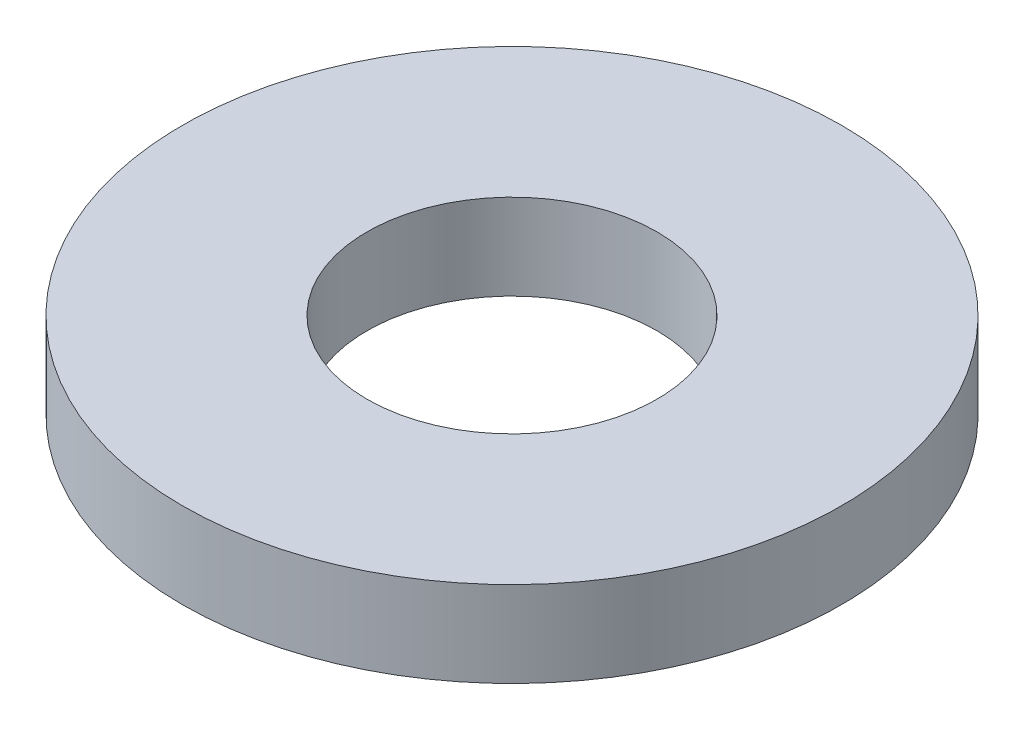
ISO-10303-21;
HEADER;
FILE_DESCRIPTION(('STEP AP214'),'2;1');
FILE_NAME('part.step','',(''),(''),'','','');
FILE_SCHEMA(('AUTOMOTIVE_DESIGN { 1 0 10303 214 1 1 1 1 }'));
ENDSEC;
DATA;
#1=APPLICATION_CONTEXT('core data for automotive mechanical design processes');
#2=APPLICATION_PROTOCOL_DEFINITION('international standard','automotive_design',2000,#1);
#3=PRODUCT_CONTEXT('',#1,'mechanical');
#4=PRODUCT('Part','Part','',(#3));
#5=PRODUCT_RELATED_PRODUCT_CATEGORY('part','',(#4));
#6=PRODUCT_DEFINITION_FORMATION('','',#4);
#7=PRODUCT_DEFINITION_CONTEXT('part definition',#1,'design');
#8=PRODUCT_DEFINITION('design','',#6,#7);
#9=PRODUCT_DEFINITION_SHAPE('','',#8);
#10=(LENGTH_UNIT() NAMED_UNIT(*) SI_UNIT(.MILLI.,.METRE.));
#11=(NAMED_UNIT(*) PLANE_ANGLE_UNIT() SI_UNIT($,.RADIAN.));
#12=(NAMED_UNIT(*) SI_UNIT($,.STERADIAN.) SOLID_ANGLE_UNIT());
#13=UNCERTAINTY_MEASURE_WITH_UNIT(LENGTH_MEASURE(1.E-05),#10,'distance_accuracy_value','');
#14=(GEOMETRIC_REPRESENTATION_CONTEXT(3) GLOBAL_UNCERTAINTY_ASSIGNED_CONTEXT((#13)) GLOBAL_UNIT_ASSIGNED_CONTEXT((#10,
#11,#12)) REPRESENTATION_CONTEXT('',''));
#15=CARTESIAN_POINT('',(0.,0.,0.));
#16=DIRECTION('',(0.,0.,1.));
#17=DIRECTION('',(1.,0.,0.));
#18=AXIS2_PLACEMENT_3D('',#15,#16,#17);
#19=CARTESIAN_POINT('',(0.,1.651,0.));
#20=DIRECTION('',(0.,-1.,0.));
#21=DIRECTION('',(0.,0.,-1.));
#22=AXIS2_PLACEMENT_3D('',#19,#20,#21);
#23=CYLINDRICAL_SURFACE('',#22,6.35);
#24=CARTESIAN_POINT('',(0.,1.651,0.));
#25=DIRECTION('',(0.,1.,0.));
#26=DIRECTION('',(0.,0.,1.));
#27=AXIS2_PLACEMENT_3D('',#24,#25,#26);
#28=CIRCLE('',#27,6.35);
#29=CARTESIAN_POINT('',(0.,1.651,-6.35));
#30=VERTEX_POINT('',#29);
#31=EDGE_CURVE('E10',#30,#30,#28,.T.);
#32=CARTESIAN_POINT('',(0.,0.,0.));
#33=DIRECTION('',(0.,1.,0.));
#34=DIRECTION('',(0.,0.,1.));
#35=AXIS2_PLACEMENT_3D('',#32,#33,#34);
#36=CIRCLE('',#35,6.35);
#37=CARTESIAN_POINT('',(0.,0.,-6.35));
#38=VERTEX_POINT('',#37);
#39=EDGE_CURVE('E34',#38,#38,#36,.T.);
#40=CARTESIAN_POINT('',(0.,1.651,-6.35));
#41=CARTESIAN_POINT('',(0.,1.63380208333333,-6.35));
#42=CARTESIAN_POINT('',(0.,1.61660416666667,-6.35));
#43=CARTESIAN_POINT('',(0.,1.58220833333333,-6.35));
#44=CARTESIAN_POINT('',(0.,1.56501041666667,-6.35));
#45=CARTESIAN_POINT('',(0.,1.53061458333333,-6.35));
#46=CARTESIAN_POINT('',(0.,1.51341666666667,-6.35));
#47=CARTESIAN_POINT('',(0.,1.47902083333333,-6.35));
#48=CARTESIAN_POINT('',(0.,1.46182291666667,-6.35));
#49=CARTESIAN_POINT('',(0.,1.42742708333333,-6.35));
#50=CARTESIAN_POINT('',(0.,1.41022916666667,-6.35));
#51=CARTESIAN_POINT('',(0.,1.37583333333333,-6.35));
#52=CARTESIAN_POINT('',(0.,1.35863541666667,-6.35));
#53=CARTESIAN_POINT('',(0.,1.32423958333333,-6.35));
#54=CARTESIAN_POINT('',(0.,1.30704166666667,-6.35));
#55=CARTESIAN_POINT('',(0.,1.27264583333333,-6.35));
#56=CARTESIAN_POINT('',(0.,1.25544791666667,-6.35));
#57=CARTESIAN_POINT('',(0.,1.22105208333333,-6.35));
#58=CARTESIAN_POINT('',(0.,1.20385416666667,-6.35));
#59=CARTESIAN_POINT('',(0.,1.16945833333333,-6.35));
#60=CARTESIAN_POINT('',(0.,1.15226041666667,-6.35));
#61=CARTESIAN_POINT('',(0.,1.11786458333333,-6.35));
#62=CARTESIAN_POINT('',(0.,1.10066666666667,-6.35));
#63=CARTESIAN_POINT('',(0.,1.06627083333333,-6.35));
#64=CARTESIAN_POINT('',(0.,1.04907291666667,-6.35));
#65=CARTESIAN_POINT('',(0.,1.01467708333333,-6.35));
#66=CARTESIAN_POINT('',(0.,0.997479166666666,-6.35));
#67=CARTESIAN_POINT('',(0.,0.963083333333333,-6.35));
#68=CARTESIAN_POINT('',(0.,0.945885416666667,-6.35));
#69=CARTESIAN_POINT('',(0.,0.911489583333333,-6.35));
#70=CARTESIAN_POINT('',(0.,0.894291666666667,-6.35));
#71=CARTESIAN_POINT('',(0.,0.859895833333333,-6.35));
#72=CARTESIAN_POINT('',(0.,0.842697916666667,-6.35));
#73=CARTESIAN_POINT('',(0.,0.808302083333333,-6.35));
#74=CARTESIAN_POINT('',(0.,0.791104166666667,-6.35));
#75=CARTESIAN_POINT('',(0.,0.756708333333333,-6.35));
#76=CARTESIAN_POINT('',(0.,0.739510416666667,-6.35));
#77=CARTESIAN_POINT('',(0.,0.705114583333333,-6.35));
#78=CARTESIAN_POINT('',(0.,0.687916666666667,-6.35));
#79=CARTESIAN_POINT('',(0.,0.653520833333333,-6.35));
#80=CARTESIAN_POINT('',(0.,0.636322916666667,-6.35));
#81=CARTESIAN_POINT('',(0.,0.601927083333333,-6.35));
#82=CARTESIAN_POINT('',(0.,0.584729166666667,-6.35));
#83=CARTESIAN_POINT('',(0.,0.550333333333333,-6.35));
#84=CARTESIAN_POINT('',(0.,0.533135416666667,-6.35));
#85=CARTESIAN_POINT('',(0.,0.498739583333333,-6.35));
#86=CARTESIAN_POINT('',(0.,0.481541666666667,-6.35));
#87=CARTESIAN_POINT('',(0.,0.447145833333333,-6.35));
#88=CARTESIAN_POINT('',(0.,0.429947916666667,-6.35));
#89=CARTESIAN_POINT('',(0.,0.395552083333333,-6.35));
#90=CARTESIAN_POINT('',(0.,0.378354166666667,-6.35));
#91=CARTESIAN_POINT('',(0.,0.343958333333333,-6.35));
#92=CARTESIAN_POINT('',(0.,0.326760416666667,-6.35));
#93=CARTESIAN_POINT('',(0.,0.292364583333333,-6.35));
#94=CARTESIAN_POINT('',(0.,0.275166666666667,-6.35));
#95=CARTESIAN_POINT('',(0.,0.240770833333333,-6.35));
#96=CARTESIAN_POINT('',(0.,0.223572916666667,-6.35));
#97=CARTESIAN_POINT('',(0.,0.189177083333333,-6.35));
#98=CARTESIAN_POINT('',(0.,0.171979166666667,-6.35));
#99=CARTESIAN_POINT('',(0.,0.137583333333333,-6.35));
#100=CARTESIAN_POINT('',(0.,0.120385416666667,-6.35));
#101=CARTESIAN_POINT('',(0.,0.0859895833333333,-6.35));
#102=CARTESIAN_POINT('',(0.,0.0687916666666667,-6.35));
#103=CARTESIAN_POINT('',(0.,0.0343958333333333,-6.35));
#104=CARTESIAN_POINT('',(0.,0.0171979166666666,-6.35));
#105=CARTESIAN_POINT('',(0.,0.,-6.35));
#106=B_SPLINE_CURVE_WITH_KNOTS('',3,(#40,#41,#42,#43,#44,#45,#46,#47,#48,#49,#50,#51,#52,#53,
#54,#55,#56,#57,#58,#59,#60,#61,#62,#63,#64,#65,#66,#67,#68,#69,#70,#71,#72,#73,#74,#75,#76,#77,
#78,#79,#80,#81,#82,#83,#84,#85,#86,#87,#88,#89,#90,#91,#92,#93,#94,#95,#96,#97,#98,#99,#100,
#101,#102,#103,#104,#105),.UNSPECIFIED.,.F.,.F.,(4,2,2,2,2,2,2,2,2,2,2,2,2,2,2,2,2,2,2,2,2,2,2,
2,2,2,2,2,2,2,2,2,4),(0.,0.05159375,0.1031875,0.15478125,0.206375,0.25796875,0.3095625,
0.36115625,0.41275,0.46434375,0.5159375,0.56753125,0.619125,0.67071875,0.7223125,0.77390625,
0.8255,0.87709375,0.9286875,0.98028125,1.031875,1.08346875,1.1350625,1.18665625,1.23825,
1.28984375,1.3414375,1.39303125,1.444625,1.49621875,1.5478125,1.59940625,1.651),.UNSPECIFIED.);
#107=EDGE_CURVE('BSEAM31',#30,#38,#106,.T.);
#108=ORIENTED_EDGE('',*,*,#31,.F.);
#109=ORIENTED_EDGE('',*,*,#39,.T.);
#110=ORIENTED_EDGE('',*,*,#107,.T.);
#111=ORIENTED_EDGE('',*,*,#107,.F.);
#112=EDGE_LOOP('',(#108,#110,#109,#111));
#113=FACE_BOUND('',#112,.T.);
#114=ADVANCED_FACE('F31',(#113),#23,.T.);
#115=CARTESIAN_POINT('',(0.,1.651,0.));
#116=DIRECTION('',(0.,1.,0.));
#117=DIRECTION('',(0.,0.,1.));
#118=AXIS2_PLACEMENT_3D('',#115,#116,#117);
#119=PLANE('',#118);
#120=CARTESIAN_POINT('',(0.,1.651,0.));
#121=DIRECTION('',(0.,1.,0.));
#122=DIRECTION('',(0.,0.,1.));
#123=AXIS2_PLACEMENT_3D('',#120,#121,#122);
#124=CIRCLE('',#123,2.794);
#125=CARTESIAN_POINT('',(0.,1.651,2.794));
#126=VERTEX_POINT('',#125);
#127=EDGE_CURVE('E43',#126,#126,#124,.T.);
#128=ORIENTED_EDGE('',*,*,#127,.F.);
#129=EDGE_LOOP('',(#128));
#130=FACE_BOUND('',#129,.T.);
#131=ORIENTED_EDGE('',*,*,#31,.T.);
#132=EDGE_LOOP('',(#131));
#133=FACE_BOUND('',#132,.T.);
#134=ADVANCED_FACE('F58',(#130,#133),#119,.T.);
#135=CARTESIAN_POINT('',(0.,0.,0.));
#136=DIRECTION('',(0.,1.,0.));
#137=DIRECTION('',(0.,0.,1.));
#138=AXIS2_PLACEMENT_3D('',#135,#136,#137);
#139=PLANE('',#138);
#140=CARTESIAN_POINT('',(0.,0.,0.));
#141=DIRECTION('',(0.,1.,0.));
#142=DIRECTION('',(0.,0.,1.));
#143=AXIS2_PLACEMENT_3D('',#140,#141,#142);
#144=CIRCLE('',#143,2.794);
#145=CARTESIAN_POINT('',(0.,0.,2.794));
#146=VERTEX_POINT('',#145);
#147=EDGE_CURVE('E41',#146,#146,#144,.T.);
#148=ORIENTED_EDGE('',*,*,#147,.T.);
#149=EDGE_LOOP('',(#148));
#150=FACE_BOUND('',#149,.T.);
#151=ORIENTED_EDGE('',*,*,#39,.F.);
#152=EDGE_LOOP('',(#151));
#153=FACE_BOUND('',#152,.T.);
#154=ADVANCED_FACE('F49',(#150,#153),#139,.F.);
#155=CARTESIAN_POINT('',(0.,0.,0.));
#156=DIRECTION('',(0.,1.,0.));
#157=DIRECTION('',(0.,0.,1.));
#158=AXIS2_PLACEMENT_3D('',#155,#156,#157);
#159=CYLINDRICAL_SURFACE('',#158,2.794);
#160=CARTESIAN_POINT('',(0.,0.,2.794));
#161=CARTESIAN_POINT('',(0.,0.0171979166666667,2.794));
#162=CARTESIAN_POINT('',(0.,0.0343958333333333,2.794));
#163=CARTESIAN_POINT('',(0.,0.0687916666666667,2.794));
#164=CARTESIAN_POINT('',(0.,0.0859895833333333,2.794));
#165=CARTESIAN_POINT('',(0.,0.120385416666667,2.794));
#166=CARTESIAN_POINT('',(0.,0.137583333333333,2.794));
#167=CARTESIAN_POINT('',(0.,0.171979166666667,2.794));
#168=CARTESIAN_POINT('',(0.,0.189177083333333,2.794));
#169=CARTESIAN_POINT('',(0.,0.223572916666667,2.794));
#170=CARTESIAN_POINT('',(0.,0.240770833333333,2.794));
#171=CARTESIAN_POINT('',(0.,0.275166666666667,2.794));
#172=CARTESIAN_POINT('',(0.,0.292364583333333,2.794));
#173=CARTESIAN_POINT('',(0.,0.326760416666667,2.794));
#174=CARTESIAN_POINT('',(0.,0.343958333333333,2.794));
#175=CARTESIAN_POINT('',(0.,0.378354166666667,2.794));
#176=CARTESIAN_POINT('',(0.,0.395552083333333,2.794));
#177=CARTESIAN_POINT('',(0.,0.429947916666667,2.794));
#178=CARTESIAN_POINT('',(0.,0.447145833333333,2.794));
#179=CARTESIAN_POINT('',(0.,0.481541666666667,2.794));
#180=CARTESIAN_POINT('',(0.,0.498739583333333,2.794));
#181=CARTESIAN_POINT('',(0.,0.533135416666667,2.794));
#182=CARTESIAN_POINT('',(0.,0.550333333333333,2.794));
#183=CARTESIAN_POINT('',(0.,0.584729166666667,2.794));
#184=CARTESIAN_POINT('',(0.,0.601927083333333,2.794));
#185=CARTESIAN_POINT('',(0.,0.636322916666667,2.794));
#186=CARTESIAN_POINT('',(0.,0.653520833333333,2.794));
#187=CARTESIAN_POINT('',(0.,0.687916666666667,2.794));
#188=CARTESIAN_POINT('',(0.,0.705114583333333,2.794));
#189=CARTESIAN_POINT('',(0.,0.739510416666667,2.794));
#190=CARTESIAN_POINT('',(0.,0.756708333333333,2.794));
#191=CARTESIAN_POINT('',(0.,0.791104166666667,2.794));
#192=CARTESIAN_POINT('',(0.,0.808302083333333,2.794));
#193=CARTESIAN_POINT('',(0.,0.842697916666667,2.794));
#194=CARTESIAN_POINT('',(0.,0.859895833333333,2.794));
#195=CARTESIAN_POINT('',(0.,0.894291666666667,2.794));
#196=CARTESIAN_POINT('',(0.,0.911489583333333,2.794));
#197=CARTESIAN_POINT('',(0.,0.945885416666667,2.794));
#198=CARTESIAN_POINT('',(0.,0.963083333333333,2.794));
#199=CARTESIAN_POINT('',(0.,0.997479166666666,2.794));
#200=CARTESIAN_POINT('',(0.,1.01467708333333,2.794));
#201=CARTESIAN_POINT('',(0.,1.04907291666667,2.794));
#202=CARTESIAN_POINT('',(0.,1.06627083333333,2.794));
#203=CARTESIAN_POINT('',(0.,1.10066666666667,2.794));
#204=CARTESIAN_POINT('',(0.,1.11786458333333,2.794));
#205=CARTESIAN_POINT('',(0.,1.15226041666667,2.794));
#206=CARTESIAN_POINT('',(0.,1.16945833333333,2.794));
#207=CARTESIAN_POINT('',(0.,1.20385416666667,2.794));
#208=CARTESIAN_POINT('',(0.,1.22105208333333,2.794));
#209=CARTESIAN_POINT('',(0.,1.25544791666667,2.794));
#210=CARTESIAN_POINT('',(0.,1.27264583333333,2.794));
#211=CARTESIAN_POINT('',(0.,1.30704166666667,2.794));
#212=CARTESIAN_POINT('',(0.,1.32423958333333,2.794));
#213=CARTESIAN_POINT('',(0.,1.35863541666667,2.794));
#214=CARTESIAN_POINT('',(0.,1.37583333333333,2.794));
#215=CARTESIAN_POINT('',(0.,1.41022916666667,2.794));
#216=CARTESIAN_POINT('',(0.,1.42742708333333,2.794));
#217=CARTESIAN_POINT('',(0.,1.46182291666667,2.794));
#218=CARTESIAN_POINT('',(0.,1.47902083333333,2.794));
#219=CARTESIAN_POINT('',(0.,1.51341666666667,2.794));
#220=CARTESIAN_POINT('',(0.,1.53061458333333,2.794));
#221=CARTESIAN_POINT('',(0.,1.56501041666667,2.794));
#222=CARTESIAN_POINT('',(0.,1.58220833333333,2.794));
#223=CARTESIAN_POINT('',(0.,1.61660416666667,2.794));
#224=CARTESIAN_POINT('',(0.,1.63380208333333,2.794));
#225=CARTESIAN_POINT('',(0.,1.651,2.794));
#226=B_SPLINE_CURVE_WITH_KNOTS('',3,(#160,#161,#162,#163,#164,#165,#166,#167,#168,#169,#170,
#171,#172,#173,#174,#175,#176,#177,#178,#179,#180,#181,#182,#183,#184,#185,#186,#187,#188,#189,
#190,#191,#192,#193,#194,#195,#196,#197,#198,#199,#200,#201,#202,#203,#204,#205,#206,#207,#208,
#209,#210,#211,#212,#213,#214,#215,#216,#217,#218,#219,#220,#221,#222,#223,#224,#225),
.UNSPECIFIED.,.F.,.F.,(4,2,2,2,2,2,2,2,2,2,2,2,2,2,2,2,2,2,2,2,2,2,2,2,2,2,2,2,2,2,2,2,4),(0.,
0.05159375,0.1031875,0.15478125,0.206375,0.25796875,0.3095625,0.36115625,0.41275,0.46434375,
0.5159375,0.56753125,0.619125,0.67071875,0.7223125,0.77390625,0.8255,0.87709375,0.9286875,
0.98028125,1.031875,1.08346875,1.1350625,1.18665625,1.23825,1.28984375,1.3414375,1.39303125,
1.444625,1.49621875,1.5478125,1.59940625,1.651),.UNSPECIFIED.);
#227=EDGE_CURVE('BSEAM52',#146,#126,#226,.T.);
#228=ORIENTED_EDGE('',*,*,#147,.F.);
#229=ORIENTED_EDGE('',*,*,#127,.T.);
#230=ORIENTED_EDGE('',*,*,#227,.T.);
#231=ORIENTED_EDGE('',*,*,#227,.F.);
#232=EDGE_LOOP('',(#228,#230,#229,#231));
#233=FACE_BOUND('',#232,.T.);
#234=ADVANCED_FACE('F52',(#233),#159,.F.);
#235=CLOSED_SHELL('',(#114,#134,#154,#234));
#236=MANIFOLD_SOLID_BREP('B2',#235);
#237=ADVANCED_BREP_SHAPE_REPRESENTATION('',(#18,#236),#14);
#238=SHAPE_DEFINITION_REPRESENTATION(#9,#237);
ENDSEC;
END-ISO-10303-21;
